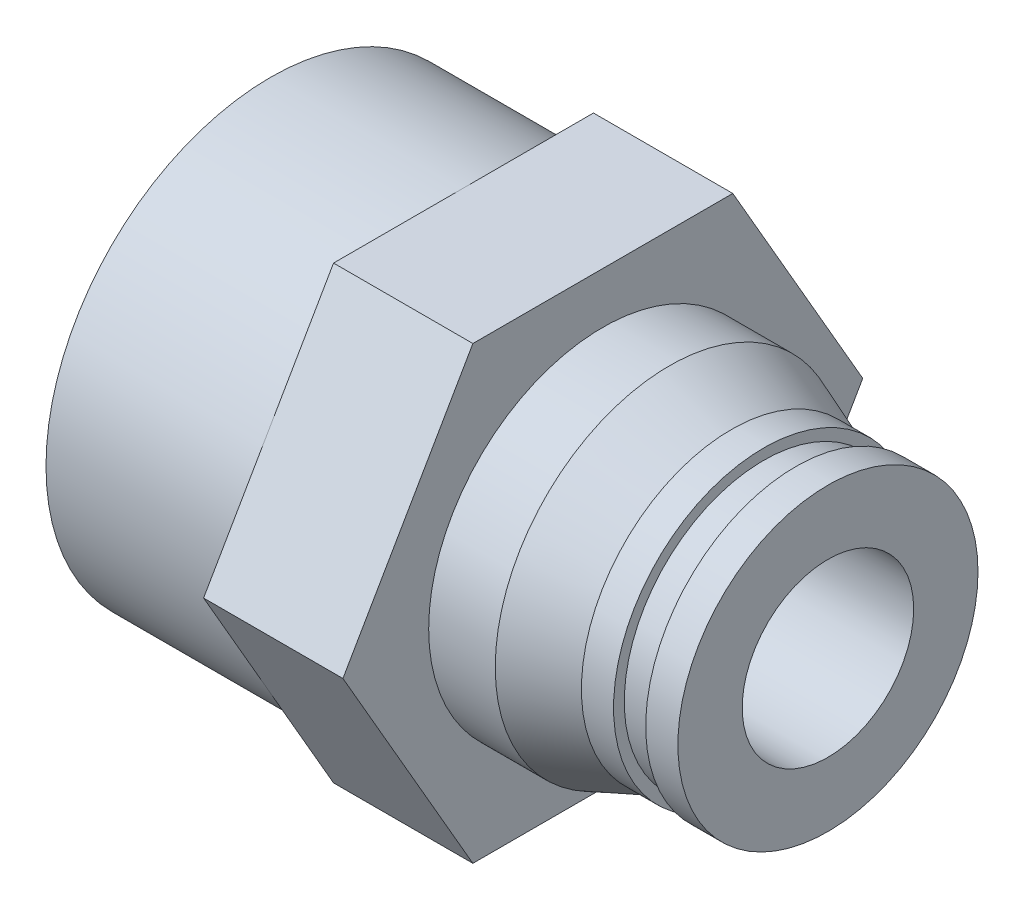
ISO-10303-21;
HEADER;
FILE_DESCRIPTION(('STEP AP214'),'2;1');
FILE_NAME('part.step','',(''),(''),'','','');
FILE_SCHEMA(('AUTOMOTIVE_DESIGN { 1 0 10303 214 1 1 1 1 }'));
ENDSEC;
DATA;
#1=APPLICATION_CONTEXT('core data for automotive mechanical design processes');
#2=APPLICATION_PROTOCOL_DEFINITION('international standard','automotive_design',2000,#1);
#3=PRODUCT_CONTEXT('',#1,'mechanical');
#4=PRODUCT('Part','Part','',(#3));
#5=PRODUCT_RELATED_PRODUCT_CATEGORY('part','',(#4));
#6=PRODUCT_DEFINITION_FORMATION('','',#4);
#7=PRODUCT_DEFINITION_CONTEXT('part definition',#1,'design');
#8=PRODUCT_DEFINITION('design','',#6,#7);
#9=PRODUCT_DEFINITION_SHAPE('','',#8);
#10=(LENGTH_UNIT() NAMED_UNIT(*) SI_UNIT(.MILLI.,.METRE.));
#11=(NAMED_UNIT(*) PLANE_ANGLE_UNIT() SI_UNIT($,.RADIAN.));
#12=(NAMED_UNIT(*) SI_UNIT($,.STERADIAN.) SOLID_ANGLE_UNIT());
#13=UNCERTAINTY_MEASURE_WITH_UNIT(LENGTH_MEASURE(1.E-05),#10,'distance_accuracy_value','');
#14=(GEOMETRIC_REPRESENTATION_CONTEXT(3) GLOBAL_UNCERTAINTY_ASSIGNED_CONTEXT((#13)) GLOBAL_UNIT_ASSIGNED_CONTEXT((#10,
#11,#12)) REPRESENTATION_CONTEXT('',''));
#15=CARTESIAN_POINT('',(0.,0.,0.));
#16=DIRECTION('',(0.,0.,1.));
#17=DIRECTION('',(1.,0.,0.));
#18=AXIS2_PLACEMENT_3D('',#15,#16,#17);
#19=CARTESIAN_POINT('',(9.,10.475,0.));
#20=DIRECTION('',(-1.,0.,0.));
#21=DIRECTION('',(0.,0.,1.));
#22=AXIS2_PLACEMENT_3D('',#19,#20,#21);
#23=PLANE('',#22);
#24=CARTESIAN_POINT('',(9.,0.,0.));
#25=DIRECTION('',(1.,0.,0.));
#26=DIRECTION('',(0.,0.,-1.));
#27=AXIS2_PLACEMENT_3D('',#24,#25,#26);
#28=CIRCLE('',#27,10.475);
#29=CARTESIAN_POINT('',(9.,0.,-10.475));
#30=VERTEX_POINT('',#29);
#31=EDGE_CURVE('E215',#30,#30,#28,.T.);
#32=ORIENTED_EDGE('',*,*,#31,.T.);
#33=EDGE_LOOP('',(#32));
#34=FACE_BOUND('',#33,.T.);
#35=DIRECTION('',(0.,-0.866025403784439,0.5));
#36=VECTOR('',#35,1.);
#37=CARTESIAN_POINT('',(9.,0.,-12.1243556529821));
#38=LINE('',#37,#36);
#39=CARTESIAN_POINT('',(9.,0.,-12.1243556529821));
#40=VERTEX_POINT('',#39);
#41=CARTESIAN_POINT('',(9.,-10.5,-6.06217782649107));
#42=VERTEX_POINT('',#41);
#43=EDGE_CURVE('E121',#40,#42,#38,.T.);
#44=ORIENTED_EDGE('',*,*,#43,.T.);
#45=DIRECTION('',(0.,0.,1.));
#46=VECTOR('',#45,1.);
#47=CARTESIAN_POINT('',(9.,-10.5,-6.06217782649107));
#48=LINE('',#47,#46);
#49=CARTESIAN_POINT('',(9.,-10.5,6.06217782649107));
#50=VERTEX_POINT('',#49);
#51=EDGE_CURVE('E106',#42,#50,#48,.T.);
#52=ORIENTED_EDGE('',*,*,#51,.T.);
#53=DIRECTION('',(0.,0.866025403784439,0.5));
#54=VECTOR('',#53,1.);
#55=CARTESIAN_POINT('',(9.,-10.5,6.06217782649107));
#56=LINE('',#55,#54);
#57=CARTESIAN_POINT('',(9.,0.,12.1243556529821));
#58=VERTEX_POINT('',#57);
#59=EDGE_CURVE('E115',#50,#58,#56,.T.);
#60=ORIENTED_EDGE('',*,*,#59,.T.);
#61=DIRECTION('',(0.,0.866025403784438,-0.5));
#62=VECTOR('',#61,1.);
#63=CARTESIAN_POINT('',(9.,0.,12.1243556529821));
#64=LINE('',#63,#62);
#65=CARTESIAN_POINT('',(9.,10.5,6.06217782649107));
#66=VERTEX_POINT('',#65);
#67=EDGE_CURVE('E30',#58,#66,#64,.T.);
#68=ORIENTED_EDGE('',*,*,#67,.T.);
#69=DIRECTION('',(0.,0.,-1.));
#70=VECTOR('',#69,1.);
#71=CARTESIAN_POINT('',(9.,10.5,6.06217782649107));
#72=LINE('',#71,#70);
#73=CARTESIAN_POINT('',(9.,10.5,-6.06217782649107));
#74=VERTEX_POINT('',#73);
#75=EDGE_CURVE('E125',#66,#74,#72,.T.);
#76=ORIENTED_EDGE('',*,*,#75,.T.);
#77=DIRECTION('',(0.,-0.866025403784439,-0.5));
#78=VECTOR('',#77,1.);
#79=CARTESIAN_POINT('',(9.,10.5,-6.06217782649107));
#80=LINE('',#79,#78);
#81=EDGE_CURVE('E128',#74,#40,#80,.T.);
#82=ORIENTED_EDGE('',*,*,#81,.T.);
#83=EDGE_LOOP('',(#44,#52,#60,#68,#76,#82));
#84=FACE_BOUND('',#83,.T.);
#85=ADVANCED_FACE('F15',(#34,#84),#23,.T.);
#86=CARTESIAN_POINT('',(15.5,12.5,0.));
#87=DIRECTION('',(1.,0.,0.));
#88=DIRECTION('',(0.,0.,-1.));
#89=AXIS2_PLACEMENT_3D('',#86,#87,#88);
#90=PLANE('',#89);
#91=CARTESIAN_POINT('',(15.5,0.,0.));
#92=DIRECTION('',(1.,0.,0.));
#93=DIRECTION('',(0.,0.,-1.));
#94=AXIS2_PLACEMENT_3D('',#91,#92,#93);
#95=CIRCLE('',#94,8.12440391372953);
#96=CARTESIAN_POINT('',(15.5,0.,-8.12440391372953));
#97=VERTEX_POINT('',#96);
#98=EDGE_CURVE('E212',#97,#97,#95,.T.);
#99=ORIENTED_EDGE('',*,*,#98,.F.);
#100=EDGE_LOOP('',(#99));
#101=FACE_BOUND('',#100,.T.);
#102=DIRECTION('',(0.,0.866025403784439,0.5));
#103=VECTOR('',#102,1.);
#104=CARTESIAN_POINT('',(15.5,-10.5,6.06217782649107));
#105=LINE('',#104,#103);
#106=CARTESIAN_POINT('',(15.5,-10.5,6.06217782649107));
#107=VERTEX_POINT('',#106);
#108=CARTESIAN_POINT('',(15.5,0.,12.1243556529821));
#109=VERTEX_POINT('',#108);
#110=EDGE_CURVE('E132',#107,#109,#105,.T.);
#111=ORIENTED_EDGE('',*,*,#110,.F.);
#112=DIRECTION('',(0.,0.,1.));
#113=VECTOR('',#112,1.);
#114=CARTESIAN_POINT('',(15.5,-10.5,-6.06217782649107));
#115=LINE('',#114,#113);
#116=CARTESIAN_POINT('',(15.5,-10.5,-6.06217782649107));
#117=VERTEX_POINT('',#116);
#118=EDGE_CURVE('E38',#117,#107,#115,.T.);
#119=ORIENTED_EDGE('',*,*,#118,.F.);
#120=DIRECTION('',(0.,-0.866025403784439,0.5));
#121=VECTOR('',#120,1.);
#122=CARTESIAN_POINT('',(15.5,0.,-12.1243556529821));
#123=LINE('',#122,#121);
#124=CARTESIAN_POINT('',(15.5,0.,-12.1243556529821));
#125=VERTEX_POINT('',#124);
#126=EDGE_CURVE('E112',#125,#117,#123,.T.);
#127=ORIENTED_EDGE('',*,*,#126,.F.);
#128=DIRECTION('',(0.,-0.866025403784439,-0.5));
#129=VECTOR('',#128,1.);
#130=CARTESIAN_POINT('',(15.5,10.5,-6.06217782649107));
#131=LINE('',#130,#129);
#132=CARTESIAN_POINT('',(15.5,10.5,-6.06217782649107));
#133=VERTEX_POINT('',#132);
#134=EDGE_CURVE('E140',#133,#125,#131,.T.);
#135=ORIENTED_EDGE('',*,*,#134,.F.);
#136=DIRECTION('',(0.,0.,-1.));
#137=VECTOR('',#136,1.);
#138=CARTESIAN_POINT('',(15.5,10.5,6.06217782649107));
#139=LINE('',#138,#137);
#140=CARTESIAN_POINT('',(15.5,10.5,6.06217782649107));
#141=VERTEX_POINT('',#140);
#142=EDGE_CURVE('E137',#141,#133,#139,.T.);
#143=ORIENTED_EDGE('',*,*,#142,.F.);
#144=DIRECTION('',(0.,0.866025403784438,-0.5));
#145=VECTOR('',#144,1.);
#146=CARTESIAN_POINT('',(15.5,0.,12.1243556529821));
#147=LINE('',#146,#145);
#148=EDGE_CURVE('E134',#109,#141,#147,.T.);
#149=ORIENTED_EDGE('',*,*,#148,.F.);
#150=EDGE_LOOP('',(#111,#119,#127,#135,#143,#149));
#151=FACE_BOUND('',#150,.T.);
#152=ADVANCED_FACE('F269',(#101,#151),#90,.T.);
#153=CARTESIAN_POINT('',(0.,0.,0.));
#154=DIRECTION('',(-1.,0.,0.));
#155=DIRECTION('',(0.,0.,1.));
#156=AXIS2_PLACEMENT_3D('',#153,#154,#155);
#157=PLANE('',#156);
#158=CARTESIAN_POINT('',(0.,0.,0.));
#159=DIRECTION('',(1.,0.,0.));
#160=DIRECTION('',(0.,0.,-1.));
#161=AXIS2_PLACEMENT_3D('',#158,#159,#160);
#162=CIRCLE('',#161,10.475);
#163=CARTESIAN_POINT('',(0.,0.,-10.475));
#164=VERTEX_POINT('',#163);
#165=EDGE_CURVE('E218',#164,#164,#162,.T.);
#166=ORIENTED_EDGE('',*,*,#165,.F.);
#167=EDGE_LOOP('',(#166));
#168=FACE_BOUND('',#167,.T.);
#169=DIRECTION('',(0.,-0.866025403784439,-0.5));
#170=VECTOR('',#169,1.);
#171=CARTESIAN_POINT('',(0.,0.,3.46410161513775));
#172=LINE('',#171,#170);
#173=CARTESIAN_POINT('',(0.,0.,3.46410161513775));
#174=VERTEX_POINT('',#173);
#175=CARTESIAN_POINT('',(0.,-3.,1.73205080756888));
#176=VERTEX_POINT('',#175);
#177=EDGE_CURVE('E169',#174,#176,#172,.T.);
#178=ORIENTED_EDGE('',*,*,#177,.T.);
#179=DIRECTION('',(0.,0.,-1.));
#180=VECTOR('',#179,1.);
#181=CARTESIAN_POINT('',(0.,-3.,1.73205080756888));
#182=LINE('',#181,#180);
#183=CARTESIAN_POINT('',(0.,-3.,-1.73205080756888));
#184=VERTEX_POINT('',#183);
#185=EDGE_CURVE('E147',#176,#184,#182,.T.);
#186=ORIENTED_EDGE('',*,*,#185,.T.);
#187=DIRECTION('',(0.,0.866025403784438,-0.5));
#188=VECTOR('',#187,1.);
#189=CARTESIAN_POINT('',(0.,-3.,-1.73205080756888));
#190=LINE('',#189,#188);
#191=CARTESIAN_POINT('',(0.,0.,-3.46410161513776));
#192=VERTEX_POINT('',#191);
#193=EDGE_CURVE('E157',#184,#192,#190,.T.);
#194=ORIENTED_EDGE('',*,*,#193,.T.);
#195=DIRECTION('',(0.,0.866025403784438,0.5));
#196=VECTOR('',#195,1.);
#197=CARTESIAN_POINT('',(0.,0.,-3.46410161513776));
#198=LINE('',#197,#196);
#199=CARTESIAN_POINT('',(0.,3.,-1.73205080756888));
#200=VERTEX_POINT('',#199);
#201=EDGE_CURVE('E160',#192,#200,#198,.T.);
#202=ORIENTED_EDGE('',*,*,#201,.T.);
#203=DIRECTION('',(0.,0.,1.));
#204=VECTOR('',#203,1.);
#205=CARTESIAN_POINT('',(0.,3.,-1.73205080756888));
#206=LINE('',#205,#204);
#207=CARTESIAN_POINT('',(0.,3.,1.73205080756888));
#208=VERTEX_POINT('',#207);
#209=EDGE_CURVE('E163',#200,#208,#206,.T.);
#210=ORIENTED_EDGE('',*,*,#209,.T.);
#211=DIRECTION('',(0.,-0.866025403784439,0.5));
#212=VECTOR('',#211,1.);
#213=CARTESIAN_POINT('',(0.,3.,1.73205080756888));
#214=LINE('',#213,#212);
#215=EDGE_CURVE('E166',#208,#174,#214,.T.);
#216=ORIENTED_EDGE('',*,*,#215,.T.);
#217=EDGE_LOOP('',(#178,#186,#194,#202,#210,#216));
#218=FACE_BOUND('',#217,.T.);
#219=ADVANCED_FACE('F17',(#168,#218),#157,.T.);
#220=CARTESIAN_POINT('',(8.49999999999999,4.,0.));
#221=DIRECTION('',(1.,0.,0.));
#222=DIRECTION('',(0.,0.,-1.));
#223=AXIS2_PLACEMENT_3D('',#220,#221,#222);
#224=PLANE('',#223);
#225=CARTESIAN_POINT('',(8.49999999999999,0.,0.));
#226=DIRECTION('',(1.,0.,0.));
#227=DIRECTION('',(0.,0.,-1.));
#228=AXIS2_PLACEMENT_3D('',#225,#226,#227);
#229=CIRCLE('',#228,4.);
#230=CARTESIAN_POINT('',(8.49999999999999,0.,-4.));
#231=VERTEX_POINT('',#230);
#232=EDGE_CURVE('E185',#231,#231,#229,.T.);
#233=ORIENTED_EDGE('',*,*,#232,.T.);
#234=EDGE_LOOP('',(#233));
#235=FACE_BOUND('',#234,.T.);
#236=DIRECTION('',(0.,-0.866025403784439,0.5));
#237=VECTOR('',#236,1.);
#238=CARTESIAN_POINT('',(8.49999999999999,1.5,-4.3301270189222));
#239=LINE('',#238,#237);
#240=CARTESIAN_POINT('',(8.49999999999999,0.,-3.46410161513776));
#241=VERTEX_POINT('',#240);
#242=CARTESIAN_POINT('',(8.49999999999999,-3.,-1.73205080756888));
#243=VERTEX_POINT('',#242);
#244=EDGE_CURVE('E23',#241,#243,#239,.T.);
#245=ORIENTED_EDGE('',*,*,#244,.T.);
#246=DIRECTION('',(0.,0.,1.));
#247=VECTOR('',#246,1.);
#248=CARTESIAN_POINT('',(8.49999999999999,-3.,0.));
#249=LINE('',#248,#247);
#250=CARTESIAN_POINT('',(8.49999999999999,-3.,1.73205080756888));
#251=VERTEX_POINT('',#250);
#252=EDGE_CURVE('E9',#243,#251,#249,.T.);
#253=ORIENTED_EDGE('',*,*,#252,.T.);
#254=DIRECTION('',(0.,0.866025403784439,0.5));
#255=VECTOR('',#254,1.);
#256=CARTESIAN_POINT('',(8.49999999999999,1.5,4.33012701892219));
#257=LINE('',#256,#255);
#258=CARTESIAN_POINT('',(8.49999999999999,0.,3.46410161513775));
#259=VERTEX_POINT('',#258);
#260=EDGE_CURVE('E221',#251,#259,#257,.T.);
#261=ORIENTED_EDGE('',*,*,#260,.T.);
#262=DIRECTION('',(0.,0.866025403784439,-0.5));
#263=VECTOR('',#262,1.);
#264=CARTESIAN_POINT('',(8.49999999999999,4.5,0.866025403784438));
#265=LINE('',#264,#263);
#266=CARTESIAN_POINT('',(8.49999999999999,3.,1.73205080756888));
#267=VERTEX_POINT('',#266);
#268=EDGE_CURVE('E224',#259,#267,#265,.T.);
#269=ORIENTED_EDGE('',*,*,#268,.T.);
#270=DIRECTION('',(0.,0.,-1.));
#271=VECTOR('',#270,1.);
#272=CARTESIAN_POINT('',(8.49999999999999,3.,0.));
#273=LINE('',#272,#271);
#274=CARTESIAN_POINT('',(8.49999999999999,3.,-1.73205080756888));
#275=VERTEX_POINT('',#274);
#276=EDGE_CURVE('E227',#267,#275,#273,.T.);
#277=ORIENTED_EDGE('',*,*,#276,.T.);
#278=DIRECTION('',(0.,-0.866025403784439,-0.5));
#279=VECTOR('',#278,1.);
#280=CARTESIAN_POINT('',(8.49999999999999,4.5,-0.866025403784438));
#281=LINE('',#280,#279);
#282=EDGE_CURVE('E230',#275,#241,#281,.T.);
#283=ORIENTED_EDGE('',*,*,#282,.T.);
#284=EDGE_LOOP('',(#245,#253,#261,#269,#277,#283));
#285=FACE_BOUND('',#284,.T.);
#286=ADVANCED_FACE('F234',(#235,#285),#224,.T.);
#287=CARTESIAN_POINT('',(0.,0.,0.));
#288=DIRECTION('',(1.,0.,0.));
#289=DIRECTION('',(0.,0.,-1.));
#290=AXIS2_PLACEMENT_3D('',#287,#288,#289);
#291=CYLINDRICAL_SURFACE('',#290,10.475);
#292=ORIENTED_EDGE('',*,*,#165,.T.);
#293=EDGE_LOOP('',(#292));
#294=FACE_BOUND('',#293,.T.);
#295=ORIENTED_EDGE('',*,*,#31,.F.);
#296=EDGE_LOOP('',(#295));
#297=FACE_BOUND('',#296,.T.);
#298=ADVANCED_FACE('F278',(#294,#297),#291,.T.);
#299=CARTESIAN_POINT('',(0.,0.,0.));
#300=DIRECTION('',(1.,0.,0.));
#301=DIRECTION('',(0.,0.,-1.));
#302=AXIS2_PLACEMENT_3D('',#299,#300,#301);
#303=CYLINDRICAL_SURFACE('',#302,8.12440391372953);
#304=ORIENTED_EDGE('',*,*,#98,.T.);
#305=EDGE_LOOP('',(#304));
#306=FACE_BOUND('',#305,.T.);
#307=CARTESIAN_POINT('',(18.6053570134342,0.,0.));
#308=DIRECTION('',(1.,0.,0.));
#309=DIRECTION('',(0.,0.,-1.));
#310=AXIS2_PLACEMENT_3D('',#307,#308,#309);
#311=CIRCLE('',#310,8.12440391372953);
#312=CARTESIAN_POINT('',(18.6053570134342,0.,-8.12440391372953));
#313=VERTEX_POINT('',#312);
#314=EDGE_CURVE('E209',#313,#313,#311,.T.);
#315=ORIENTED_EDGE('',*,*,#314,.F.);
#316=EDGE_LOOP('',(#315));
#317=FACE_BOUND('',#316,.T.);
#318=ADVANCED_FACE('F280',(#306,#317),#303,.T.);
#319=CARTESIAN_POINT('',(21.5,0.,0.));
#320=DIRECTION('',(-1.,0.,0.));
#321=DIRECTION('',(0.,0.,1.));
#322=AXIS2_PLACEMENT_3D('',#319,#320,#321);
#323=CONICAL_SURFACE('',#322,7.,0.370503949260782);
#324=ORIENTED_EDGE('',*,*,#314,.T.);
#325=EDGE_LOOP('',(#324));
#326=FACE_BOUND('',#325,.T.);
#327=CARTESIAN_POINT('',(21.5,0.,0.));
#328=DIRECTION('',(1.,0.,0.));
#329=DIRECTION('',(0.,0.,-1.));
#330=AXIS2_PLACEMENT_3D('',#327,#328,#329);
#331=CIRCLE('',#330,7.);
#332=CARTESIAN_POINT('',(21.5,0.,-7.));
#333=VERTEX_POINT('',#332);
#334=EDGE_CURVE('E206',#333,#333,#331,.T.);
#335=ORIENTED_EDGE('',*,*,#334,.F.);
#336=EDGE_LOOP('',(#335));
#337=FACE_BOUND('',#336,.T.);
#338=ADVANCED_FACE('F286',(#326,#337),#323,.T.);
#339=CARTESIAN_POINT('',(0.,0.,0.));
#340=DIRECTION('',(1.,0.,0.));
#341=DIRECTION('',(0.,0.,-1.));
#342=AXIS2_PLACEMENT_3D('',#339,#340,#341);
#343=CYLINDRICAL_SURFACE('',#342,7.);
#344=ORIENTED_EDGE('',*,*,#334,.T.);
#345=EDGE_LOOP('',(#344));
#346=FACE_BOUND('',#345,.T.);
#347=CARTESIAN_POINT('',(23.,0.,0.));
#348=DIRECTION('',(1.,0.,0.));
#349=DIRECTION('',(0.,0.,-1.));
#350=AXIS2_PLACEMENT_3D('',#347,#348,#349);
#351=CIRCLE('',#350,7.);
#352=CARTESIAN_POINT('',(23.,0.,-7.));
#353=VERTEX_POINT('',#352);
#354=EDGE_CURVE('E203',#353,#353,#351,.T.);
#355=ORIENTED_EDGE('',*,*,#354,.F.);
#356=EDGE_LOOP('',(#355));
#357=FACE_BOUND('',#356,.T.);
#358=ADVANCED_FACE('F330',(#346,#357),#343,.T.);
#359=CARTESIAN_POINT('',(23.,7.,0.));
#360=DIRECTION('',(1.,0.,0.));
#361=DIRECTION('',(0.,0.,-1.));
#362=AXIS2_PLACEMENT_3D('',#359,#360,#361);
#363=PLANE('',#362);
#364=ORIENTED_EDGE('',*,*,#354,.T.);
#365=EDGE_LOOP('',(#364));
#366=FACE_BOUND('',#365,.T.);
#367=CARTESIAN_POINT('',(23.,0.,0.));
#368=DIRECTION('',(1.,0.,0.));
#369=DIRECTION('',(0.,0.,-1.));
#370=AXIS2_PLACEMENT_3D('',#367,#368,#369);
#371=CIRCLE('',#370,6.5);
#372=CARTESIAN_POINT('',(23.,0.,-6.5));
#373=VERTEX_POINT('',#372);
#374=EDGE_CURVE('E200',#373,#373,#371,.T.);
#375=ORIENTED_EDGE('',*,*,#374,.F.);
#376=EDGE_LOOP('',(#375));
#377=FACE_BOUND('',#376,.T.);
#378=ADVANCED_FACE('F340',(#366,#377),#363,.T.);
#379=CARTESIAN_POINT('',(0.,0.,0.));
#380=DIRECTION('',(1.,0.,0.));
#381=DIRECTION('',(0.,0.,-1.));
#382=AXIS2_PLACEMENT_3D('',#379,#380,#381);
#383=CYLINDRICAL_SURFACE('',#382,6.5);
#384=ORIENTED_EDGE('',*,*,#374,.T.);
#385=EDGE_LOOP('',(#384));
#386=FACE_BOUND('',#385,.T.);
#387=CARTESIAN_POINT('',(24.5,0.,0.));
#388=DIRECTION('',(1.,0.,0.));
#389=DIRECTION('',(0.,0.,-1.));
#390=AXIS2_PLACEMENT_3D('',#387,#388,#389);
#391=CIRCLE('',#390,6.5);
#392=CARTESIAN_POINT('',(24.5,0.,-6.5));
#393=VERTEX_POINT('',#392);
#394=EDGE_CURVE('E197',#393,#393,#391,.T.);
#395=ORIENTED_EDGE('',*,*,#394,.F.);
#396=EDGE_LOOP('',(#395));
#397=FACE_BOUND('',#396,.T.);
#398=ADVANCED_FACE('F350',(#386,#397),#383,.T.);
#399=CARTESIAN_POINT('',(24.5,6.5,0.));
#400=DIRECTION('',(-1.,0.,0.));
#401=DIRECTION('',(0.,0.,1.));
#402=AXIS2_PLACEMENT_3D('',#399,#400,#401);
#403=PLANE('',#402);
#404=ORIENTED_EDGE('',*,*,#394,.T.);
#405=EDGE_LOOP('',(#404));
#406=FACE_BOUND('',#405,.T.);
#407=CARTESIAN_POINT('',(24.5,0.,0.));
#408=DIRECTION('',(1.,0.,0.));
#409=DIRECTION('',(0.,0.,-1.));
#410=AXIS2_PLACEMENT_3D('',#407,#408,#409);
#411=CIRCLE('',#410,7.);
#412=CARTESIAN_POINT('',(24.5,0.,-7.));
#413=VERTEX_POINT('',#412);
#414=EDGE_CURVE('E194',#413,#413,#411,.T.);
#415=ORIENTED_EDGE('',*,*,#414,.F.);
#416=EDGE_LOOP('',(#415));
#417=FACE_BOUND('',#416,.T.);
#418=ADVANCED_FACE('F361',(#406,#417),#403,.T.);
#419=CARTESIAN_POINT('',(0.,0.,0.));
#420=DIRECTION('',(1.,0.,0.));
#421=DIRECTION('',(0.,0.,-1.));
#422=AXIS2_PLACEMENT_3D('',#419,#420,#421);
#423=CYLINDRICAL_SURFACE('',#422,7.);
#424=ORIENTED_EDGE('',*,*,#414,.T.);
#425=EDGE_LOOP('',(#424));
#426=FACE_BOUND('',#425,.T.);
#427=CARTESIAN_POINT('',(26.,0.,0.));
#428=DIRECTION('',(1.,0.,0.));
#429=DIRECTION('',(0.,0.,-1.));
#430=AXIS2_PLACEMENT_3D('',#427,#428,#429);
#431=CIRCLE('',#430,7.);
#432=CARTESIAN_POINT('',(26.,0.,-7.));
#433=VERTEX_POINT('',#432);
#434=EDGE_CURVE('E191',#433,#433,#431,.T.);
#435=ORIENTED_EDGE('',*,*,#434,.F.);
#436=EDGE_LOOP('',(#435));
#437=FACE_BOUND('',#436,.T.);
#438=ADVANCED_FACE('F375',(#426,#437),#423,.T.);
#439=CARTESIAN_POINT('',(26.,7.,0.));
#440=DIRECTION('',(1.,0.,0.));
#441=DIRECTION('',(0.,0.,-1.));
#442=AXIS2_PLACEMENT_3D('',#439,#440,#441);
#443=PLANE('',#442);
#444=ORIENTED_EDGE('',*,*,#434,.T.);
#445=EDGE_LOOP('',(#444));
#446=FACE_BOUND('',#445,.T.);
#447=CARTESIAN_POINT('',(26.,0.,0.));
#448=DIRECTION('',(1.,0.,0.));
#449=DIRECTION('',(0.,0.,-1.));
#450=AXIS2_PLACEMENT_3D('',#447,#448,#449);
#451=CIRCLE('',#450,4.);
#452=CARTESIAN_POINT('',(26.,0.,-4.));
#453=VERTEX_POINT('',#452);
#454=EDGE_CURVE('E188',#453,#453,#451,.T.);
#455=ORIENTED_EDGE('',*,*,#454,.F.);
#456=EDGE_LOOP('',(#455));
#457=FACE_BOUND('',#456,.T.);
#458=ADVANCED_FACE('F385',(#446,#457),#443,.T.);
#459=CARTESIAN_POINT('',(0.,0.,0.));
#460=DIRECTION('',(1.,0.,0.));
#461=DIRECTION('',(0.,0.,-1.));
#462=AXIS2_PLACEMENT_3D('',#459,#460,#461);
#463=CYLINDRICAL_SURFACE('',#462,4.);
#464=ORIENTED_EDGE('',*,*,#454,.T.);
#465=EDGE_LOOP('',(#464));
#466=FACE_BOUND('',#465,.T.);
#467=ORIENTED_EDGE('',*,*,#232,.F.);
#468=EDGE_LOOP('',(#467));
#469=FACE_BOUND('',#468,.T.);
#470=ADVANCED_FACE('F396',(#466,#469),#463,.F.);
#471=CARTESIAN_POINT('',(26.,-3.,1.73205080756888));
#472=DIRECTION('',(0.,1.,0.));
#473=DIRECTION('',(0.,0.,1.));
#474=AXIS2_PLACEMENT_3D('',#471,#472,#473);
#475=PLANE('',#474);
#476=DIRECTION('',(-1.,0.,0.));
#477=VECTOR('',#476,1.);
#478=CARTESIAN_POINT('',(26.,-3.,-1.73205080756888));
#479=LINE('',#478,#477);
#480=EDGE_CURVE('E183',#243,#184,#479,.T.);
#481=ORIENTED_EDGE('',*,*,#480,.T.);
#482=ORIENTED_EDGE('',*,*,#185,.F.);
#483=DIRECTION('',(-1.,0.,0.));
#484=VECTOR('',#483,1.);
#485=CARTESIAN_POINT('',(26.,-3.,1.73205080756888));
#486=LINE('',#485,#484);
#487=EDGE_CURVE('E172',#251,#176,#486,.T.);
#488=ORIENTED_EDGE('',*,*,#487,.F.);
#489=ORIENTED_EDGE('',*,*,#252,.F.);
#490=EDGE_LOOP('',(#481,#482,#488,#489));
#491=FACE_BOUND('',#490,.T.);
#492=ADVANCED_FACE('F249',(#491),#475,.T.);
#493=CARTESIAN_POINT('',(26.,-3.,-1.73205080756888));
#494=DIRECTION('',(0.,0.5,0.866025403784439));
#495=DIRECTION('',(0.,-0.866025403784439,0.5));
#496=AXIS2_PLACEMENT_3D('',#493,#494,#495);
#497=PLANE('',#496);
#498=DIRECTION('',(-1.,0.,0.));
#499=VECTOR('',#498,1.);
#500=CARTESIAN_POINT('',(26.,0.,-3.46410161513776));
#501=LINE('',#500,#499);
#502=EDGE_CURVE('E181',#241,#192,#501,.T.);
#503=ORIENTED_EDGE('',*,*,#502,.T.);
#504=ORIENTED_EDGE('',*,*,#193,.F.);
#505=ORIENTED_EDGE('',*,*,#480,.F.);
#506=ORIENTED_EDGE('',*,*,#244,.F.);
#507=EDGE_LOOP('',(#503,#504,#505,#506));
#508=FACE_BOUND('',#507,.T.);
#509=ADVANCED_FACE('F238',(#508),#497,.T.);
#510=CARTESIAN_POINT('',(26.,0.,-3.46410161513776));
#511=DIRECTION('',(0.,-0.5,0.866025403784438));
#512=DIRECTION('',(0.,-0.866025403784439,-0.5));
#513=AXIS2_PLACEMENT_3D('',#510,#511,#512);
#514=PLANE('',#513);
#515=DIRECTION('',(-1.,0.,0.));
#516=VECTOR('',#515,1.);
#517=CARTESIAN_POINT('',(26.,3.,-1.73205080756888));
#518=LINE('',#517,#516);
#519=EDGE_CURVE('E179',#275,#200,#518,.T.);
#520=ORIENTED_EDGE('',*,*,#519,.T.);
#521=ORIENTED_EDGE('',*,*,#201,.F.);
#522=ORIENTED_EDGE('',*,*,#502,.F.);
#523=ORIENTED_EDGE('',*,*,#282,.F.);
#524=EDGE_LOOP('',(#520,#521,#522,#523));
#525=FACE_BOUND('',#524,.T.);
#526=ADVANCED_FACE('F242',(#525),#514,.T.);
#527=CARTESIAN_POINT('',(26.,3.,-1.73205080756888));
#528=DIRECTION('',(0.,-1.,0.));
#529=DIRECTION('',(0.,0.,-1.));
#530=AXIS2_PLACEMENT_3D('',#527,#528,#529);
#531=PLANE('',#530);
#532=DIRECTION('',(-1.,0.,0.));
#533=VECTOR('',#532,1.);
#534=CARTESIAN_POINT('',(26.,3.,1.73205080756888));
#535=LINE('',#534,#533);
#536=EDGE_CURVE('E177',#267,#208,#535,.T.);
#537=ORIENTED_EDGE('',*,*,#536,.T.);
#538=ORIENTED_EDGE('',*,*,#209,.F.);
#539=ORIENTED_EDGE('',*,*,#519,.F.);
#540=ORIENTED_EDGE('',*,*,#276,.F.);
#541=EDGE_LOOP('',(#537,#538,#539,#540));
#542=FACE_BOUND('',#541,.T.);
#543=ADVANCED_FACE('F258',(#542),#531,.T.);
#544=CARTESIAN_POINT('',(26.,3.,1.73205080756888));
#545=DIRECTION('',(0.,-0.5,-0.866025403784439));
#546=DIRECTION('',(0.,0.866025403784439,-0.5));
#547=AXIS2_PLACEMENT_3D('',#544,#545,#546);
#548=PLANE('',#547);
#549=DIRECTION('',(-1.,0.,0.));
#550=VECTOR('',#549,1.);
#551=CARTESIAN_POINT('',(26.,0.,3.46410161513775));
#552=LINE('',#551,#550);
#553=EDGE_CURVE('E175',#259,#174,#552,.T.);
#554=ORIENTED_EDGE('',*,*,#553,.T.);
#555=ORIENTED_EDGE('',*,*,#215,.F.);
#556=ORIENTED_EDGE('',*,*,#536,.F.);
#557=ORIENTED_EDGE('',*,*,#268,.F.);
#558=EDGE_LOOP('',(#554,#555,#556,#557));
#559=FACE_BOUND('',#558,.T.);
#560=ADVANCED_FACE('F255',(#559),#548,.T.);
#561=CARTESIAN_POINT('',(26.,0.,3.46410161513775));
#562=DIRECTION('',(0.,0.5,-0.866025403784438));
#563=DIRECTION('',(0.,0.866025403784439,0.5));
#564=AXIS2_PLACEMENT_3D('',#561,#562,#563);
#565=PLANE('',#564);
#566=ORIENTED_EDGE('',*,*,#487,.T.);
#567=ORIENTED_EDGE('',*,*,#177,.F.);
#568=ORIENTED_EDGE('',*,*,#553,.F.);
#569=ORIENTED_EDGE('',*,*,#260,.F.);
#570=EDGE_LOOP('',(#566,#567,#568,#569));
#571=FACE_BOUND('',#570,.T.);
#572=ADVANCED_FACE('F251',(#571),#565,.T.);
#573=CARTESIAN_POINT('',(15.5,-10.5,-6.06217782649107));
#574=DIRECTION('',(0.,-1.,0.));
#575=DIRECTION('',(0.,0.,-1.));
#576=AXIS2_PLACEMENT_3D('',#573,#574,#575);
#577=PLANE('',#576);
#578=DIRECTION('',(-1.,0.,0.));
#579=VECTOR('',#578,1.);
#580=CARTESIAN_POINT('',(15.5,-10.5,-6.06217782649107));
#581=LINE('',#580,#579);
#582=EDGE_CURVE('E145',#117,#42,#581,.T.);
#583=ORIENTED_EDGE('',*,*,#582,.F.);
#584=ORIENTED_EDGE('',*,*,#118,.T.);
#585=DIRECTION('',(-1.,0.,0.));
#586=VECTOR('',#585,1.);
#587=CARTESIAN_POINT('',(15.5,-10.5,6.06217782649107));
#588=LINE('',#587,#586);
#589=EDGE_CURVE('E102',#107,#50,#588,.T.);
#590=ORIENTED_EDGE('',*,*,#589,.T.);
#591=ORIENTED_EDGE('',*,*,#51,.F.);
#592=EDGE_LOOP('',(#583,#584,#590,#591));
#593=FACE_BOUND('',#592,.T.);
#594=ADVANCED_FACE('F104',(#593),#577,.T.);
#595=CARTESIAN_POINT('',(15.5,0.,-12.1243556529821));
#596=DIRECTION('',(0.,-0.5,-0.866025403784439));
#597=DIRECTION('',(0.,0.866025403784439,-0.5));
#598=AXIS2_PLACEMENT_3D('',#595,#596,#597);
#599=PLANE('',#598);
#600=DIRECTION('',(-1.,0.,0.));
#601=VECTOR('',#600,1.);
#602=CARTESIAN_POINT('',(15.5,0.,-12.1243556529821));
#603=LINE('',#602,#601);
#604=EDGE_CURVE('E148',#125,#40,#603,.T.);
#605=ORIENTED_EDGE('',*,*,#604,.F.);
#606=ORIENTED_EDGE('',*,*,#126,.T.);
#607=ORIENTED_EDGE('',*,*,#582,.T.);
#608=ORIENTED_EDGE('',*,*,#43,.F.);
#609=EDGE_LOOP('',(#605,#606,#607,#608));
#610=FACE_BOUND('',#609,.T.);
#611=ADVANCED_FACE('F457',(#610),#599,.T.);
#612=CARTESIAN_POINT('',(15.5,10.5,-6.06217782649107));
#613=DIRECTION('',(0.,0.5,-0.866025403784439));
#614=DIRECTION('',(0.,0.866025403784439,0.5));
#615=AXIS2_PLACEMENT_3D('',#612,#613,#614);
#616=PLANE('',#615);
#617=DIRECTION('',(-1.,0.,0.));
#618=VECTOR('',#617,1.);
#619=CARTESIAN_POINT('',(15.5,10.5,-6.06217782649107));
#620=LINE('',#619,#618);
#621=EDGE_CURVE('E150',#133,#74,#620,.T.);
#622=ORIENTED_EDGE('',*,*,#621,.F.);
#623=ORIENTED_EDGE('',*,*,#134,.T.);
#624=ORIENTED_EDGE('',*,*,#604,.T.);
#625=ORIENTED_EDGE('',*,*,#81,.F.);
#626=EDGE_LOOP('',(#622,#623,#624,#625));
#627=FACE_BOUND('',#626,.T.);
#628=ADVANCED_FACE('F466',(#627),#616,.T.);
#629=CARTESIAN_POINT('',(15.5,10.5,6.06217782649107));
#630=DIRECTION('',(0.,1.,0.));
#631=DIRECTION('',(0.,0.,1.));
#632=AXIS2_PLACEMENT_3D('',#629,#630,#631);
#633=PLANE('',#632);
#634=DIRECTION('',(-1.,0.,0.));
#635=VECTOR('',#634,1.);
#636=CARTESIAN_POINT('',(15.5,10.5,6.06217782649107));
#637=LINE('',#636,#635);
#638=EDGE_CURVE('E152',#141,#66,#637,.T.);
#639=ORIENTED_EDGE('',*,*,#638,.F.);
#640=ORIENTED_EDGE('',*,*,#142,.T.);
#641=ORIENTED_EDGE('',*,*,#621,.T.);
#642=ORIENTED_EDGE('',*,*,#75,.F.);
#643=EDGE_LOOP('',(#639,#640,#641,#642));
#644=FACE_BOUND('',#643,.T.);
#645=ADVANCED_FACE('F476',(#644),#633,.T.);
#646=CARTESIAN_POINT('',(15.5,0.,12.1243556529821));
#647=DIRECTION('',(0.,0.5,0.866025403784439));
#648=DIRECTION('',(0.,-0.866025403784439,0.5));
#649=AXIS2_PLACEMENT_3D('',#646,#647,#648);
#650=PLANE('',#649);
#651=DIRECTION('',(-1.,0.,0.));
#652=VECTOR('',#651,1.);
#653=CARTESIAN_POINT('',(15.5,0.,12.1243556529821));
#654=LINE('',#653,#652);
#655=EDGE_CURVE('E111',#109,#58,#654,.T.);
#656=ORIENTED_EDGE('',*,*,#655,.F.);
#657=ORIENTED_EDGE('',*,*,#148,.T.);
#658=ORIENTED_EDGE('',*,*,#638,.T.);
#659=ORIENTED_EDGE('',*,*,#67,.F.);
#660=EDGE_LOOP('',(#656,#657,#658,#659));
#661=FACE_BOUND('',#660,.T.);
#662=ADVANCED_FACE('F486',(#661),#650,.T.);
#663=CARTESIAN_POINT('',(15.5,-10.5,6.06217782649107));
#664=DIRECTION('',(0.,-0.5,0.866025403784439));
#665=DIRECTION('',(0.,-0.866025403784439,-0.5));
#666=AXIS2_PLACEMENT_3D('',#663,#664,#665);
#667=PLANE('',#666);
#668=ORIENTED_EDGE('',*,*,#589,.F.);
#669=ORIENTED_EDGE('',*,*,#110,.T.);
#670=ORIENTED_EDGE('',*,*,#655,.T.);
#671=ORIENTED_EDGE('',*,*,#59,.F.);
#672=EDGE_LOOP('',(#668,#669,#670,#671));
#673=FACE_BOUND('',#672,.T.);
#674=ADVANCED_FACE('F116',(#673),#667,.T.);
#675=CLOSED_SHELL('',(#85,#152,#219,#286,#298,#318,#338,#358,#378,#398,#418,#438,#458,#470,#492,
#509,#526,#543,#560,#572,#594,#611,#628,#645,#662,#674));
#676=MANIFOLD_SOLID_BREP('B1',#675);
#677=ADVANCED_BREP_SHAPE_REPRESENTATION('',(#18,#676),#14);
#678=SHAPE_DEFINITION_REPRESENTATION(#9,#677);
ENDSEC;
END-ISO-10303-21;
